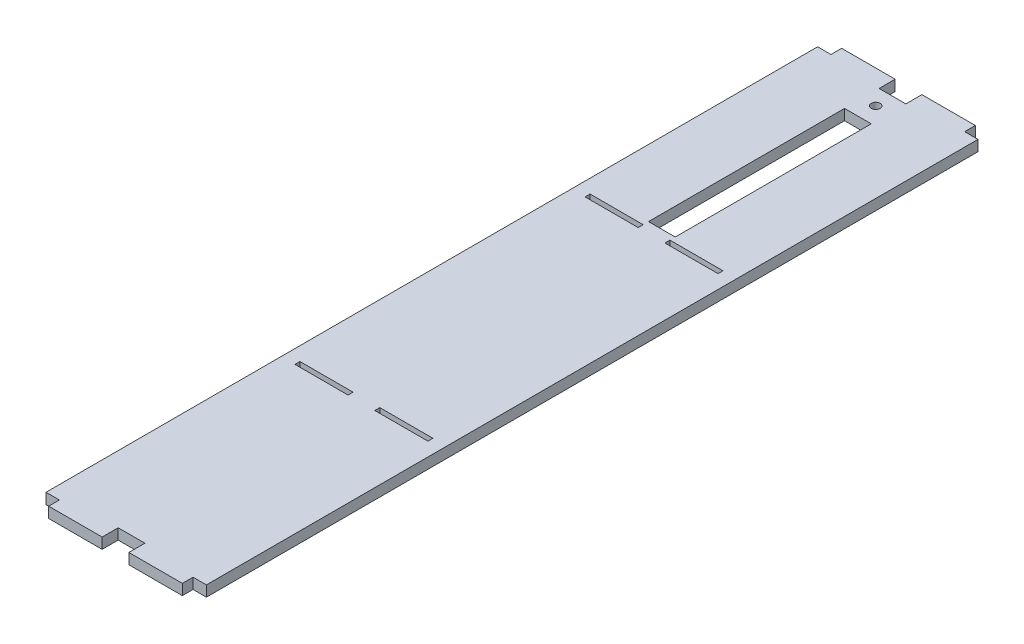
ISO-10303-21;
HEADER;
FILE_DESCRIPTION(('STEP AP214'),'2;1');
FILE_NAME('part.step','',(''),(''),'','','');
FILE_SCHEMA(('AUTOMOTIVE_DESIGN { 1 0 10303 214 1 1 1 1 }'));
ENDSEC;
DATA;
#1=APPLICATION_CONTEXT('core data for automotive mechanical design processes');
#2=APPLICATION_PROTOCOL_DEFINITION('international standard','automotive_design',2000,#1);
#3=PRODUCT_CONTEXT('',#1,'mechanical');
#4=PRODUCT('Part','Part','',(#3));
#5=PRODUCT_RELATED_PRODUCT_CATEGORY('part','',(#4));
#6=PRODUCT_DEFINITION_FORMATION('','',#4);
#7=PRODUCT_DEFINITION_CONTEXT('part definition',#1,'design');
#8=PRODUCT_DEFINITION('design','',#6,#7);
#9=PRODUCT_DEFINITION_SHAPE('','',#8);
#10=(LENGTH_UNIT() NAMED_UNIT(*) SI_UNIT(.MILLI.,.METRE.));
#11=(NAMED_UNIT(*) PLANE_ANGLE_UNIT() SI_UNIT($,.RADIAN.));
#12=(NAMED_UNIT(*) SI_UNIT($,.STERADIAN.) SOLID_ANGLE_UNIT());
#13=UNCERTAINTY_MEASURE_WITH_UNIT(LENGTH_MEASURE(1.E-05),#10,'distance_accuracy_value','');
#14=(GEOMETRIC_REPRESENTATION_CONTEXT(3) GLOBAL_UNCERTAINTY_ASSIGNED_CONTEXT((#13)) GLOBAL_UNIT_ASSIGNED_CONTEXT((#10,
#11,#12)) REPRESENTATION_CONTEXT('',''));
#15=CARTESIAN_POINT('',(0.,0.,0.));
#16=DIRECTION('',(0.,0.,1.));
#17=DIRECTION('',(1.,0.,0.));
#18=AXIS2_PLACEMENT_3D('',#15,#16,#17);
#19=CARTESIAN_POINT('',(0.,6.,0.));
#20=DIRECTION('',(0.,-1.,0.));
#21=DIRECTION('',(0.,0.,-1.));
#22=AXIS2_PLACEMENT_3D('',#19,#20,#21);
#23=PLANE('',#22);
#24=DIRECTION('',(-1.,0.,0.));
#25=VECTOR('',#24,1.);
#26=CARTESIAN_POINT('',(7.69999999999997,6.,-297.6));
#27=LINE('',#26,#25);
#28=CARTESIAN_POINT('',(37.5,6.,-297.6));
#29=VERTEX_POINT('',#28);
#30=CARTESIAN_POINT('',(7.69999999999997,6.,-297.6));
#31=VERTEX_POINT('',#30);
#32=EDGE_CURVE('E329',#29,#31,#27,.T.);
#33=ORIENTED_EDGE('',*,*,#32,.F.);
#34=DIRECTION('',(0.,0.,-1.));
#35=VECTOR('',#34,1.);
#36=CARTESIAN_POINT('',(37.5,6.,-297.6));
#37=LINE('',#36,#35);
#38=CARTESIAN_POINT('',(37.5,6.,-294.8));
#39=VERTEX_POINT('',#38);
#40=EDGE_CURVE('E337',#39,#29,#37,.T.);
#41=ORIENTED_EDGE('',*,*,#40,.F.);
#42=DIRECTION('',(1.,0.,0.));
#43=VECTOR('',#42,1.);
#44=CARTESIAN_POINT('',(7.69999999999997,6.,-294.8));
#45=LINE('',#44,#43);
#46=CARTESIAN_POINT('',(7.69999999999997,6.,-294.8));
#47=VERTEX_POINT('',#46);
#48=EDGE_CURVE('E334',#47,#39,#45,.T.);
#49=ORIENTED_EDGE('',*,*,#48,.F.);
#50=DIRECTION('',(0.,0.,1.));
#51=VECTOR('',#50,1.);
#52=CARTESIAN_POINT('',(7.69999999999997,6.,-297.6));
#53=LINE('',#52,#51);
#54=EDGE_CURVE('E331',#31,#47,#53,.T.);
#55=ORIENTED_EDGE('',*,*,#54,.F.);
#56=EDGE_LOOP('',(#33,#41,#49,#55));
#57=FACE_BOUND('',#56,.T.);
#58=DIRECTION('',(0.,0.,1.));
#59=VECTOR('',#58,1.);
#60=CARTESIAN_POINT('',(52.5,6.,-132.));
#61=LINE('',#60,#59);
#62=CARTESIAN_POINT('',(52.5,6.,-134.8));
#63=VERTEX_POINT('',#62);
#64=CARTESIAN_POINT('',(52.5,6.,-132.));
#65=VERTEX_POINT('',#64);
#66=EDGE_CURVE('E391',#63,#65,#61,.T.);
#67=ORIENTED_EDGE('',*,*,#66,.F.);
#68=DIRECTION('',(-1.,0.,0.));
#69=VECTOR('',#68,1.);
#70=CARTESIAN_POINT('',(82.3,6.,-134.8));
#71=LINE('',#70,#69);
#72=CARTESIAN_POINT('',(82.3,6.,-134.8));
#73=VERTEX_POINT('',#72);
#74=EDGE_CURVE('E399',#73,#63,#71,.T.);
#75=ORIENTED_EDGE('',*,*,#74,.F.);
#76=DIRECTION('',(0.,0.,-1.));
#77=VECTOR('',#76,1.);
#78=CARTESIAN_POINT('',(82.3,6.,-132.));
#79=LINE('',#78,#77);
#80=CARTESIAN_POINT('',(82.3,6.,-132.));
#81=VERTEX_POINT('',#80);
#82=EDGE_CURVE('E396',#81,#73,#79,.T.);
#83=ORIENTED_EDGE('',*,*,#82,.F.);
#84=DIRECTION('',(1.,0.,0.));
#85=VECTOR('',#84,1.);
#86=CARTESIAN_POINT('',(82.3,6.,-132.));
#87=LINE('',#86,#85);
#88=EDGE_CURVE('E393',#65,#81,#87,.T.);
#89=ORIENTED_EDGE('',*,*,#88,.F.);
#90=EDGE_LOOP('',(#67,#75,#83,#89));
#91=FACE_BOUND('',#90,.T.);
#92=DIRECTION('',(0.,0.,1.));
#93=VECTOR('',#92,1.);
#94=CARTESIAN_POINT('',(0.,6.,0.));
#95=LINE('',#94,#93);
#96=CARTESIAN_POINT('',(0.,6.,-433.));
#97=VERTEX_POINT('',#96);
#98=CARTESIAN_POINT('',(0.,6.,0.));
#99=VERTEX_POINT('',#98);
#100=EDGE_CURVE('E453',#97,#99,#95,.T.);
#101=ORIENTED_EDGE('',*,*,#100,.T.);
#102=DIRECTION('',(1.,0.,0.));
#103=VECTOR('',#102,1.);
#104=CARTESIAN_POINT('',(0.,6.,0.));
#105=LINE('',#104,#103);
#106=CARTESIAN_POINT('',(7.5,6.,0.));
#107=VERTEX_POINT('',#106);
#108=EDGE_CURVE('E456',#99,#107,#105,.T.);
#109=ORIENTED_EDGE('',*,*,#108,.T.);
#110=DIRECTION('',(0.,0.,1.));
#111=VECTOR('',#110,1.);
#112=CARTESIAN_POINT('',(7.5,6.,6.));
#113=LINE('',#112,#111);
#114=CARTESIAN_POINT('',(7.5,6.,6.));
#115=VERTEX_POINT('',#114);
#116=EDGE_CURVE('E459',#107,#115,#113,.T.);
#117=ORIENTED_EDGE('',*,*,#116,.T.);
#118=DIRECTION('',(1.,0.,0.));
#119=VECTOR('',#118,1.);
#120=CARTESIAN_POINT('',(7.5,6.,6.));
#121=LINE('',#120,#119);
#122=CARTESIAN_POINT('',(37.5,6.,6.));
#123=VERTEX_POINT('',#122);
#124=EDGE_CURVE('E461',#115,#123,#121,.T.);
#125=ORIENTED_EDGE('',*,*,#124,.T.);
#126=DIRECTION('',(0.,0.,-1.));
#127=VECTOR('',#126,1.);
#128=CARTESIAN_POINT('',(37.5,6.,6.));
#129=LINE('',#128,#127);
#130=CARTESIAN_POINT('',(37.5,6.,-3.));
#131=VERTEX_POINT('',#130);
#132=EDGE_CURVE('E463',#123,#131,#129,.T.);
#133=ORIENTED_EDGE('',*,*,#132,.T.);
#134=DIRECTION('',(1.,0.,0.));
#135=VECTOR('',#134,1.);
#136=CARTESIAN_POINT('',(37.5,6.,-3.));
#137=LINE('',#136,#135);
#138=CARTESIAN_POINT('',(52.5,6.,-3.));
#139=VERTEX_POINT('',#138);
#140=EDGE_CURVE('E465',#131,#139,#137,.T.);
#141=ORIENTED_EDGE('',*,*,#140,.T.);
#142=DIRECTION('',(0.,0.,1.));
#143=VECTOR('',#142,1.);
#144=CARTESIAN_POINT('',(52.5,6.,0.));
#145=LINE('',#144,#143);
#146=CARTESIAN_POINT('',(52.5,6.,6.));
#147=VERTEX_POINT('',#146);
#148=EDGE_CURVE('E467',#139,#147,#145,.T.);
#149=ORIENTED_EDGE('',*,*,#148,.T.);
#150=DIRECTION('',(1.,0.,0.));
#151=VECTOR('',#150,1.);
#152=CARTESIAN_POINT('',(82.5,6.,6.));
#153=LINE('',#152,#151);
#154=CARTESIAN_POINT('',(82.5,6.,6.));
#155=VERTEX_POINT('',#154);
#156=EDGE_CURVE('E469',#147,#155,#153,.T.);
#157=ORIENTED_EDGE('',*,*,#156,.T.);
#158=DIRECTION('',(0.,0.,-1.));
#159=VECTOR('',#158,1.);
#160=CARTESIAN_POINT('',(82.5,6.,6.));
#161=LINE('',#160,#159);
#162=CARTESIAN_POINT('',(82.5,6.,0.));
#163=VERTEX_POINT('',#162);
#164=EDGE_CURVE('E471',#155,#163,#161,.T.);
#165=ORIENTED_EDGE('',*,*,#164,.T.);
#166=DIRECTION('',(1.,0.,0.));
#167=VECTOR('',#166,1.);
#168=CARTESIAN_POINT('',(82.5,6.,0.));
#169=LINE('',#168,#167);
#170=CARTESIAN_POINT('',(90.,6.,0.));
#171=VERTEX_POINT('',#170);
#172=EDGE_CURVE('E473',#163,#171,#169,.T.);
#173=ORIENTED_EDGE('',*,*,#172,.T.);
#174=DIRECTION('',(0.,0.,-1.));
#175=VECTOR('',#174,1.);
#176=CARTESIAN_POINT('',(90.,6.,0.));
#177=LINE('',#176,#175);
#178=CARTESIAN_POINT('',(90.,6.,-433.));
#179=VERTEX_POINT('',#178);
#180=EDGE_CURVE('E475',#171,#179,#177,.T.);
#181=ORIENTED_EDGE('',*,*,#180,.T.);
#182=DIRECTION('',(-1.,0.,0.));
#183=VECTOR('',#182,1.);
#184=CARTESIAN_POINT('',(82.4999999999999,6.,-433.));
#185=LINE('',#184,#183);
#186=CARTESIAN_POINT('',(82.4999999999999,6.,-433.));
#187=VERTEX_POINT('',#186);
#188=EDGE_CURVE('E477',#179,#187,#185,.T.);
#189=ORIENTED_EDGE('',*,*,#188,.T.);
#190=DIRECTION('',(0.,0.,-1.));
#191=VECTOR('',#190,1.);
#192=CARTESIAN_POINT('',(82.5,6.,-439.));
#193=LINE('',#192,#191);
#194=CARTESIAN_POINT('',(82.5,6.,-439.));
#195=VERTEX_POINT('',#194);
#196=EDGE_CURVE('E479',#187,#195,#193,.T.);
#197=ORIENTED_EDGE('',*,*,#196,.T.);
#198=DIRECTION('',(-1.,0.,0.));
#199=VECTOR('',#198,1.);
#200=CARTESIAN_POINT('',(82.5,6.,-439.));
#201=LINE('',#200,#199);
#202=CARTESIAN_POINT('',(52.5,6.,-439.));
#203=VERTEX_POINT('',#202);
#204=EDGE_CURVE('E481',#195,#203,#201,.T.);
#205=ORIENTED_EDGE('',*,*,#204,.T.);
#206=DIRECTION('',(0.,0.,1.));
#207=VECTOR('',#206,1.);
#208=CARTESIAN_POINT('',(52.5,6.,-439.));
#209=LINE('',#208,#207);
#210=CARTESIAN_POINT('',(52.5,6.,-430.));
#211=VERTEX_POINT('',#210);
#212=EDGE_CURVE('E483',#203,#211,#209,.T.);
#213=ORIENTED_EDGE('',*,*,#212,.T.);
#214=DIRECTION('',(-1.,0.,0.));
#215=VECTOR('',#214,1.);
#216=CARTESIAN_POINT('',(37.5,6.,-430.));
#217=LINE('',#216,#215);
#218=CARTESIAN_POINT('',(37.5,6.,-430.));
#219=VERTEX_POINT('',#218);
#220=EDGE_CURVE('E485',#211,#219,#217,.T.);
#221=ORIENTED_EDGE('',*,*,#220,.T.);
#222=DIRECTION('',(0.,0.,-1.));
#223=VECTOR('',#222,1.);
#224=CARTESIAN_POINT('',(37.5,6.,-433.));
#225=LINE('',#224,#223);
#226=CARTESIAN_POINT('',(37.5,6.,-439.));
#227=VERTEX_POINT('',#226);
#228=EDGE_CURVE('E487',#219,#227,#225,.T.);
#229=ORIENTED_EDGE('',*,*,#228,.T.);
#230=DIRECTION('',(-1.,0.,0.));
#231=VECTOR('',#230,1.);
#232=CARTESIAN_POINT('',(7.49999999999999,6.,-439.));
#233=LINE('',#232,#231);
#234=CARTESIAN_POINT('',(7.49999999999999,6.,-439.));
#235=VERTEX_POINT('',#234);
#236=EDGE_CURVE('E489',#227,#235,#233,.T.);
#237=ORIENTED_EDGE('',*,*,#236,.T.);
#238=DIRECTION('',(0.,0.,1.));
#239=VECTOR('',#238,1.);
#240=CARTESIAN_POINT('',(7.49999999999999,6.,-439.));
#241=LINE('',#240,#239);
#242=CARTESIAN_POINT('',(7.5,6.,-433.));
#243=VERTEX_POINT('',#242);
#244=EDGE_CURVE('E491',#235,#243,#241,.T.);
#245=ORIENTED_EDGE('',*,*,#244,.T.);
#246=DIRECTION('',(-1.,0.,0.));
#247=VECTOR('',#246,1.);
#248=CARTESIAN_POINT('',(0.,6.,-433.));
#249=LINE('',#248,#247);
#250=EDGE_CURVE('E493',#243,#97,#249,.T.);
#251=ORIENTED_EDGE('',*,*,#250,.T.);
#252=EDGE_LOOP('',(#101,#109,#117,#125,#133,#141,#149,#157,#165,#173,#181,#189,#197,#205,#213,
#221,#229,#237,#245,#251));
#253=FACE_BOUND('',#252,.T.);
#254=DIRECTION('',(1.,0.,0.));
#255=VECTOR('',#254,1.);
#256=CARTESIAN_POINT('',(7.69999999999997,6.,-132.));
#257=LINE('',#256,#255);
#258=CARTESIAN_POINT('',(7.69999999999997,6.,-132.));
#259=VERTEX_POINT('',#258);
#260=CARTESIAN_POINT('',(37.5,6.,-132.));
#261=VERTEX_POINT('',#260);
#262=EDGE_CURVE('E422',#259,#261,#257,.T.);
#263=ORIENTED_EDGE('',*,*,#262,.F.);
#264=DIRECTION('',(0.,0.,1.));
#265=VECTOR('',#264,1.);
#266=CARTESIAN_POINT('',(7.69999999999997,6.,-132.));
#267=LINE('',#266,#265);
#268=CARTESIAN_POINT('',(7.69999999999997,6.,-134.8));
#269=VERTEX_POINT('',#268);
#270=EDGE_CURVE('E430',#269,#259,#267,.T.);
#271=ORIENTED_EDGE('',*,*,#270,.F.);
#272=DIRECTION('',(-1.,0.,0.));
#273=VECTOR('',#272,1.);
#274=CARTESIAN_POINT('',(7.69999999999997,6.,-134.8));
#275=LINE('',#274,#273);
#276=CARTESIAN_POINT('',(37.5,6.,-134.8));
#277=VERTEX_POINT('',#276);
#278=EDGE_CURVE('E427',#277,#269,#275,.T.);
#279=ORIENTED_EDGE('',*,*,#278,.F.);
#280=DIRECTION('',(0.,0.,-1.));
#281=VECTOR('',#280,1.);
#282=CARTESIAN_POINT('',(37.5,6.,-132.));
#283=LINE('',#282,#281);
#284=EDGE_CURVE('E424',#261,#277,#283,.T.);
#285=ORIENTED_EDGE('',*,*,#284,.F.);
#286=EDGE_LOOP('',(#263,#271,#279,#285));
#287=FACE_BOUND('',#286,.T.);
#288=DIRECTION('',(1.,0.,0.));
#289=VECTOR('',#288,1.);
#290=CARTESIAN_POINT('',(82.3,6.,-294.8));
#291=LINE('',#290,#289);
#292=CARTESIAN_POINT('',(52.5,6.,-294.8));
#293=VERTEX_POINT('',#292);
#294=CARTESIAN_POINT('',(82.3,6.,-294.8));
#295=VERTEX_POINT('',#294);
#296=EDGE_CURVE('E360',#293,#295,#291,.T.);
#297=ORIENTED_EDGE('',*,*,#296,.F.);
#298=DIRECTION('',(0.,0.,1.));
#299=VECTOR('',#298,1.);
#300=CARTESIAN_POINT('',(52.5,6.,-297.6));
#301=LINE('',#300,#299);
#302=CARTESIAN_POINT('',(52.5,6.,-297.6));
#303=VERTEX_POINT('',#302);
#304=EDGE_CURVE('E368',#303,#293,#301,.T.);
#305=ORIENTED_EDGE('',*,*,#304,.F.);
#306=DIRECTION('',(-1.,0.,0.));
#307=VECTOR('',#306,1.);
#308=CARTESIAN_POINT('',(82.3,6.,-297.6));
#309=LINE('',#308,#307);
#310=CARTESIAN_POINT('',(82.3,6.,-297.6));
#311=VERTEX_POINT('',#310);
#312=EDGE_CURVE('E365',#311,#303,#309,.T.);
#313=ORIENTED_EDGE('',*,*,#312,.F.);
#314=DIRECTION('',(0.,0.,-1.));
#315=VECTOR('',#314,1.);
#316=CARTESIAN_POINT('',(82.3,6.,-297.6));
#317=LINE('',#316,#315);
#318=EDGE_CURVE('E362',#295,#311,#317,.T.);
#319=ORIENTED_EDGE('',*,*,#318,.F.);
#320=EDGE_LOOP('',(#297,#305,#313,#319));
#321=FACE_BOUND('',#320,.T.);
#322=DIRECTION('',(0.,0.,1.));
#323=VECTOR('',#322,1.);
#324=CARTESIAN_POINT('',(37.5,6.,-410.6));
#325=LINE('',#324,#323);
#326=CARTESIAN_POINT('',(37.5,6.,-410.6));
#327=VERTEX_POINT('',#326);
#328=CARTESIAN_POINT('',(37.5,6.,-300.6));
#329=VERTEX_POINT('',#328);
#330=EDGE_CURVE('E290',#327,#329,#325,.T.);
#331=ORIENTED_EDGE('',*,*,#330,.F.);
#332=DIRECTION('',(-1.,0.,0.));
#333=VECTOR('',#332,1.);
#334=CARTESIAN_POINT('',(37.5,6.,-410.6));
#335=LINE('',#334,#333);
#336=CARTESIAN_POINT('',(52.5,6.,-410.6));
#337=VERTEX_POINT('',#336);
#338=EDGE_CURVE('E313',#337,#327,#335,.T.);
#339=ORIENTED_EDGE('',*,*,#338,.F.);
#340=DIRECTION('',(0.,0.,-1.));
#341=VECTOR('',#340,1.);
#342=CARTESIAN_POINT('',(52.5,6.,-410.6));
#343=LINE('',#342,#341);
#344=CARTESIAN_POINT('',(52.5,6.,-300.6));
#345=VERTEX_POINT('',#344);
#346=EDGE_CURVE('E311',#345,#337,#343,.T.);
#347=ORIENTED_EDGE('',*,*,#346,.F.);
#348=DIRECTION('',(1.,0.,0.));
#349=VECTOR('',#348,1.);
#350=CARTESIAN_POINT('',(37.5,6.,-300.6));
#351=LINE('',#350,#349);
#352=EDGE_CURVE('E298',#329,#345,#351,.T.);
#353=ORIENTED_EDGE('',*,*,#352,.F.);
#354=EDGE_LOOP('',(#331,#339,#347,#353));
#355=FACE_BOUND('',#354,.T.);
#356=CARTESIAN_POINT('',(45.,6.,-420.6));
#357=DIRECTION('',(0.,1.,0.));
#358=DIRECTION('',(0.,0.,1.));
#359=AXIS2_PLACEMENT_3D('',#356,#357,#358);
#360=CIRCLE('',#359,2.5);
#361=CARTESIAN_POINT('',(45.,6.,-418.1));
#362=VERTEX_POINT('',#361);
#363=EDGE_CURVE('E319',#362,#362,#360,.T.);
#364=ORIENTED_EDGE('',*,*,#363,.F.);
#365=EDGE_LOOP('',(#364));
#366=FACE_BOUND('',#365,.T.);
#367=ADVANCED_FACE('F33',(#57,#91,#253,#287,#321,#355,#366),#23,.F.);
#368=CARTESIAN_POINT('',(0.,0.,0.));
#369=DIRECTION('',(0.,-1.,0.));
#370=DIRECTION('',(0.,0.,-1.));
#371=AXIS2_PLACEMENT_3D('',#368,#369,#370);
#372=PLANE('',#371);
#373=DIRECTION('',(-1.,0.,0.));
#374=VECTOR('',#373,1.);
#375=CARTESIAN_POINT('',(37.5,0.,-410.6));
#376=LINE('',#375,#374);
#377=CARTESIAN_POINT('',(52.5,0.,-410.6));
#378=VERTEX_POINT('',#377);
#379=CARTESIAN_POINT('',(37.5,0.,-410.6));
#380=VERTEX_POINT('',#379);
#381=EDGE_CURVE('E299',#378,#380,#376,.T.);
#382=ORIENTED_EDGE('',*,*,#381,.T.);
#383=DIRECTION('',(0.,0.,1.));
#384=VECTOR('',#383,1.);
#385=CARTESIAN_POINT('',(37.5,0.,-410.6));
#386=LINE('',#385,#384);
#387=CARTESIAN_POINT('',(37.5,0.,-300.6));
#388=VERTEX_POINT('',#387);
#389=EDGE_CURVE('E56',#380,#388,#386,.T.);
#390=ORIENTED_EDGE('',*,*,#389,.T.);
#391=DIRECTION('',(1.,0.,0.));
#392=VECTOR('',#391,1.);
#393=CARTESIAN_POINT('',(37.5,0.,-300.6));
#394=LINE('',#393,#392);
#395=CARTESIAN_POINT('',(52.5,0.,-300.6));
#396=VERTEX_POINT('',#395);
#397=EDGE_CURVE('E305',#388,#396,#394,.T.);
#398=ORIENTED_EDGE('',*,*,#397,.T.);
#399=DIRECTION('',(0.,0.,-1.));
#400=VECTOR('',#399,1.);
#401=CARTESIAN_POINT('',(52.5,0.,-410.6));
#402=LINE('',#401,#400);
#403=EDGE_CURVE('E321',#396,#378,#402,.T.);
#404=ORIENTED_EDGE('',*,*,#403,.T.);
#405=EDGE_LOOP('',(#382,#390,#398,#404));
#406=FACE_BOUND('',#405,.T.);
#407=DIRECTION('',(0.,0.,-1.));
#408=VECTOR('',#407,1.);
#409=CARTESIAN_POINT('',(37.5,0.,-297.6));
#410=LINE('',#409,#408);
#411=CARTESIAN_POINT('',(37.5,0.,-294.8));
#412=VERTEX_POINT('',#411);
#413=CARTESIAN_POINT('',(37.5,0.,-297.6));
#414=VERTEX_POINT('',#413);
#415=EDGE_CURVE('E332',#412,#414,#410,.T.);
#416=ORIENTED_EDGE('',*,*,#415,.T.);
#417=DIRECTION('',(-1.,0.,0.));
#418=VECTOR('',#417,1.);
#419=CARTESIAN_POINT('',(7.69999999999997,0.,-297.6));
#420=LINE('',#419,#418);
#421=CARTESIAN_POINT('',(7.69999999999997,0.,-297.6));
#422=VERTEX_POINT('',#421);
#423=EDGE_CURVE('E306',#414,#422,#420,.T.);
#424=ORIENTED_EDGE('',*,*,#423,.T.);
#425=DIRECTION('',(0.,0.,1.));
#426=VECTOR('',#425,1.);
#427=CARTESIAN_POINT('',(7.69999999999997,0.,-297.6));
#428=LINE('',#427,#426);
#429=CARTESIAN_POINT('',(7.69999999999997,0.,-294.8));
#430=VERTEX_POINT('',#429);
#431=EDGE_CURVE('E342',#422,#430,#428,.T.);
#432=ORIENTED_EDGE('',*,*,#431,.T.);
#433=DIRECTION('',(1.,0.,0.));
#434=VECTOR('',#433,1.);
#435=CARTESIAN_POINT('',(7.69999999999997,0.,-294.8));
#436=LINE('',#435,#434);
#437=EDGE_CURVE('E345',#430,#412,#436,.T.);
#438=ORIENTED_EDGE('',*,*,#437,.T.);
#439=EDGE_LOOP('',(#416,#424,#432,#438));
#440=FACE_BOUND('',#439,.T.);
#441=DIRECTION('',(0.,0.,1.));
#442=VECTOR('',#441,1.);
#443=CARTESIAN_POINT('',(52.5,0.,-297.6));
#444=LINE('',#443,#442);
#445=CARTESIAN_POINT('',(52.5,0.,-297.6));
#446=VERTEX_POINT('',#445);
#447=CARTESIAN_POINT('',(52.5,0.,-294.8));
#448=VERTEX_POINT('',#447);
#449=EDGE_CURVE('E363',#446,#448,#444,.T.);
#450=ORIENTED_EDGE('',*,*,#449,.T.);
#451=DIRECTION('',(1.,0.,0.));
#452=VECTOR('',#451,1.);
#453=CARTESIAN_POINT('',(82.3,0.,-294.8));
#454=LINE('',#453,#452);
#455=CARTESIAN_POINT('',(82.3,0.,-294.8));
#456=VERTEX_POINT('',#455);
#457=EDGE_CURVE('E359',#448,#456,#454,.T.);
#458=ORIENTED_EDGE('',*,*,#457,.T.);
#459=DIRECTION('',(0.,0.,-1.));
#460=VECTOR('',#459,1.);
#461=CARTESIAN_POINT('',(82.3,0.,-297.6));
#462=LINE('',#461,#460);
#463=CARTESIAN_POINT('',(82.3,0.,-297.6));
#464=VERTEX_POINT('',#463);
#465=EDGE_CURVE('E373',#456,#464,#462,.T.);
#466=ORIENTED_EDGE('',*,*,#465,.T.);
#467=DIRECTION('',(-1.,0.,0.));
#468=VECTOR('',#467,1.);
#469=CARTESIAN_POINT('',(82.3,0.,-297.6));
#470=LINE('',#469,#468);
#471=EDGE_CURVE('E376',#464,#446,#470,.T.);
#472=ORIENTED_EDGE('',*,*,#471,.T.);
#473=EDGE_LOOP('',(#450,#458,#466,#472));
#474=FACE_BOUND('',#473,.T.);
#475=DIRECTION('',(-1.,0.,0.));
#476=VECTOR('',#475,1.);
#477=CARTESIAN_POINT('',(82.3,0.,-134.8));
#478=LINE('',#477,#476);
#479=CARTESIAN_POINT('',(82.3,0.,-134.8));
#480=VERTEX_POINT('',#479);
#481=CARTESIAN_POINT('',(52.5,0.,-134.8));
#482=VERTEX_POINT('',#481);
#483=EDGE_CURVE('E394',#480,#482,#478,.T.);
#484=ORIENTED_EDGE('',*,*,#483,.T.);
#485=DIRECTION('',(0.,0.,1.));
#486=VECTOR('',#485,1.);
#487=CARTESIAN_POINT('',(52.5,0.,-132.));
#488=LINE('',#487,#486);
#489=CARTESIAN_POINT('',(52.5,0.,-132.));
#490=VERTEX_POINT('',#489);
#491=EDGE_CURVE('E390',#482,#490,#488,.T.);
#492=ORIENTED_EDGE('',*,*,#491,.T.);
#493=DIRECTION('',(1.,0.,0.));
#494=VECTOR('',#493,1.);
#495=CARTESIAN_POINT('',(82.3,0.,-132.));
#496=LINE('',#495,#494);
#497=CARTESIAN_POINT('',(82.3,0.,-132.));
#498=VERTEX_POINT('',#497);
#499=EDGE_CURVE('E404',#490,#498,#496,.T.);
#500=ORIENTED_EDGE('',*,*,#499,.T.);
#501=DIRECTION('',(0.,0.,-1.));
#502=VECTOR('',#501,1.);
#503=CARTESIAN_POINT('',(82.3,0.,-132.));
#504=LINE('',#503,#502);
#505=EDGE_CURVE('E407',#498,#480,#504,.T.);
#506=ORIENTED_EDGE('',*,*,#505,.T.);
#507=EDGE_LOOP('',(#484,#492,#500,#506));
#508=FACE_BOUND('',#507,.T.);
#509=DIRECTION('',(0.,0.,1.));
#510=VECTOR('',#509,1.);
#511=CARTESIAN_POINT('',(7.69999999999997,0.,-132.));
#512=LINE('',#511,#510);
#513=CARTESIAN_POINT('',(7.69999999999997,0.,-134.8));
#514=VERTEX_POINT('',#513);
#515=CARTESIAN_POINT('',(7.69999999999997,0.,-132.));
#516=VERTEX_POINT('',#515);
#517=EDGE_CURVE('E425',#514,#516,#512,.T.);
#518=ORIENTED_EDGE('',*,*,#517,.T.);
#519=DIRECTION('',(1.,0.,0.));
#520=VECTOR('',#519,1.);
#521=CARTESIAN_POINT('',(7.69999999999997,0.,-132.));
#522=LINE('',#521,#520);
#523=CARTESIAN_POINT('',(37.5,0.,-132.));
#524=VERTEX_POINT('',#523);
#525=EDGE_CURVE('E421',#516,#524,#522,.T.);
#526=ORIENTED_EDGE('',*,*,#525,.T.);
#527=DIRECTION('',(0.,0.,-1.));
#528=VECTOR('',#527,1.);
#529=CARTESIAN_POINT('',(37.5,0.,-132.));
#530=LINE('',#529,#528);
#531=CARTESIAN_POINT('',(37.5,0.,-134.8));
#532=VERTEX_POINT('',#531);
#533=EDGE_CURVE('E435',#524,#532,#530,.T.);
#534=ORIENTED_EDGE('',*,*,#533,.T.);
#535=DIRECTION('',(-1.,0.,0.));
#536=VECTOR('',#535,1.);
#537=CARTESIAN_POINT('',(7.69999999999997,0.,-134.8));
#538=LINE('',#537,#536);
#539=EDGE_CURVE('E438',#532,#514,#538,.T.);
#540=ORIENTED_EDGE('',*,*,#539,.T.);
#541=EDGE_LOOP('',(#518,#526,#534,#540));
#542=FACE_BOUND('',#541,.T.);
#543=DIRECTION('',(0.,0.,1.));
#544=VECTOR('',#543,1.);
#545=CARTESIAN_POINT('',(0.,0.,0.));
#546=LINE('',#545,#544);
#547=CARTESIAN_POINT('',(0.,0.,-433.));
#548=VERTEX_POINT('',#547);
#549=CARTESIAN_POINT('',(0.,0.,0.));
#550=VERTEX_POINT('',#549);
#551=EDGE_CURVE('E452',#548,#550,#546,.T.);
#552=ORIENTED_EDGE('',*,*,#551,.F.);
#553=DIRECTION('',(-1.,0.,0.));
#554=VECTOR('',#553,1.);
#555=CARTESIAN_POINT('',(0.,0.,-433.));
#556=LINE('',#555,#554);
#557=CARTESIAN_POINT('',(7.5,0.,-433.));
#558=VERTEX_POINT('',#557);
#559=EDGE_CURVE('E457',#558,#548,#556,.T.);
#560=ORIENTED_EDGE('',*,*,#559,.F.);
#561=DIRECTION('',(0.,0.,1.));
#562=VECTOR('',#561,1.);
#563=CARTESIAN_POINT('',(7.49999999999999,0.,-439.));
#564=LINE('',#563,#562);
#565=CARTESIAN_POINT('',(7.49999999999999,0.,-439.));
#566=VERTEX_POINT('',#565);
#567=EDGE_CURVE('E536',#566,#558,#564,.T.);
#568=ORIENTED_EDGE('',*,*,#567,.F.);
#569=DIRECTION('',(-1.,0.,0.));
#570=VECTOR('',#569,1.);
#571=CARTESIAN_POINT('',(7.49999999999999,0.,-439.));
#572=LINE('',#571,#570);
#573=CARTESIAN_POINT('',(37.5,0.,-439.));
#574=VERTEX_POINT('',#573);
#575=EDGE_CURVE('E534',#574,#566,#572,.T.);
#576=ORIENTED_EDGE('',*,*,#575,.F.);
#577=DIRECTION('',(0.,0.,-1.));
#578=VECTOR('',#577,1.);
#579=CARTESIAN_POINT('',(37.5,0.,-439.));
#580=LINE('',#579,#578);
#581=CARTESIAN_POINT('',(37.5,0.,-430.));
#582=VERTEX_POINT('',#581);
#583=EDGE_CURVE('E532',#582,#574,#580,.T.);
#584=ORIENTED_EDGE('',*,*,#583,.F.);
#585=DIRECTION('',(-1.,0.,0.));
#586=VECTOR('',#585,1.);
#587=CARTESIAN_POINT('',(37.5,0.,-430.));
#588=LINE('',#587,#586);
#589=CARTESIAN_POINT('',(52.5,0.,-430.));
#590=VERTEX_POINT('',#589);
#591=EDGE_CURVE('E529',#590,#582,#588,.T.);
#592=ORIENTED_EDGE('',*,*,#591,.F.);
#593=DIRECTION('',(0.,0.,1.));
#594=VECTOR('',#593,1.);
#595=CARTESIAN_POINT('',(52.5,0.,-433.));
#596=LINE('',#595,#594);
#597=CARTESIAN_POINT('',(52.5,0.,-439.));
#598=VERTEX_POINT('',#597);
#599=EDGE_CURVE('E527',#598,#590,#596,.T.);
#600=ORIENTED_EDGE('',*,*,#599,.F.);
#601=DIRECTION('',(-1.,0.,0.));
#602=VECTOR('',#601,1.);
#603=CARTESIAN_POINT('',(82.5,0.,-439.));
#604=LINE('',#603,#602);
#605=CARTESIAN_POINT('',(82.5,0.,-439.));
#606=VERTEX_POINT('',#605);
#607=EDGE_CURVE('E524',#606,#598,#604,.T.);
#608=ORIENTED_EDGE('',*,*,#607,.F.);
#609=DIRECTION('',(0.,0.,-1.));
#610=VECTOR('',#609,1.);
#611=CARTESIAN_POINT('',(82.5,0.,-439.));
#612=LINE('',#611,#610);
#613=CARTESIAN_POINT('',(82.4999999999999,0.,-433.));
#614=VERTEX_POINT('',#613);
#615=EDGE_CURVE('E522',#614,#606,#612,.T.);
#616=ORIENTED_EDGE('',*,*,#615,.F.);
#617=DIRECTION('',(-1.,0.,0.));
#618=VECTOR('',#617,1.);
#619=CARTESIAN_POINT('',(82.4999999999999,0.,-433.));
#620=LINE('',#619,#618);
#621=CARTESIAN_POINT('',(90.,0.,-433.));
#622=VERTEX_POINT('',#621);
#623=EDGE_CURVE('E520',#622,#614,#620,.T.);
#624=ORIENTED_EDGE('',*,*,#623,.F.);
#625=DIRECTION('',(0.,0.,-1.));
#626=VECTOR('',#625,1.);
#627=CARTESIAN_POINT('',(90.,0.,0.));
#628=LINE('',#627,#626);
#629=CARTESIAN_POINT('',(90.,0.,0.));
#630=VERTEX_POINT('',#629);
#631=EDGE_CURVE('E518',#630,#622,#628,.T.);
#632=ORIENTED_EDGE('',*,*,#631,.F.);
#633=DIRECTION('',(1.,0.,0.));
#634=VECTOR('',#633,1.);
#635=CARTESIAN_POINT('',(82.5,0.,0.));
#636=LINE('',#635,#634);
#637=CARTESIAN_POINT('',(82.5,0.,0.));
#638=VERTEX_POINT('',#637);
#639=EDGE_CURVE('E516',#638,#630,#636,.T.);
#640=ORIENTED_EDGE('',*,*,#639,.F.);
#641=DIRECTION('',(0.,0.,-1.));
#642=VECTOR('',#641,1.);
#643=CARTESIAN_POINT('',(82.5,0.,6.));
#644=LINE('',#643,#642);
#645=CARTESIAN_POINT('',(82.5,0.,6.));
#646=VERTEX_POINT('',#645);
#647=EDGE_CURVE('E514',#646,#638,#644,.T.);
#648=ORIENTED_EDGE('',*,*,#647,.F.);
#649=DIRECTION('',(1.,0.,0.));
#650=VECTOR('',#649,1.);
#651=CARTESIAN_POINT('',(82.5,0.,6.));
#652=LINE('',#651,#650);
#653=CARTESIAN_POINT('',(52.5,0.,6.));
#654=VERTEX_POINT('',#653);
#655=EDGE_CURVE('E512',#654,#646,#652,.T.);
#656=ORIENTED_EDGE('',*,*,#655,.F.);
#657=DIRECTION('',(0.,0.,1.));
#658=VECTOR('',#657,1.);
#659=CARTESIAN_POINT('',(52.5,0.,6.));
#660=LINE('',#659,#658);
#661=CARTESIAN_POINT('',(52.5,0.,-3.));
#662=VERTEX_POINT('',#661);
#663=EDGE_CURVE('E510',#662,#654,#660,.T.);
#664=ORIENTED_EDGE('',*,*,#663,.F.);
#665=DIRECTION('',(1.,0.,0.));
#666=VECTOR('',#665,1.);
#667=CARTESIAN_POINT('',(37.5,0.,-3.));
#668=LINE('',#667,#666);
#669=CARTESIAN_POINT('',(37.5,0.,-3.));
#670=VERTEX_POINT('',#669);
#671=EDGE_CURVE('E507',#670,#662,#668,.T.);
#672=ORIENTED_EDGE('',*,*,#671,.F.);
#673=DIRECTION('',(0.,0.,-1.));
#674=VECTOR('',#673,1.);
#675=CARTESIAN_POINT('',(37.5,0.,0.));
#676=LINE('',#675,#674);
#677=CARTESIAN_POINT('',(37.5,0.,6.));
#678=VERTEX_POINT('',#677);
#679=EDGE_CURVE('E505',#678,#670,#676,.T.);
#680=ORIENTED_EDGE('',*,*,#679,.F.);
#681=DIRECTION('',(1.,0.,0.));
#682=VECTOR('',#681,1.);
#683=CARTESIAN_POINT('',(7.5,0.,6.));
#684=LINE('',#683,#682);
#685=CARTESIAN_POINT('',(7.5,0.,6.));
#686=VERTEX_POINT('',#685);
#687=EDGE_CURVE('E502',#686,#678,#684,.T.);
#688=ORIENTED_EDGE('',*,*,#687,.F.);
#689=DIRECTION('',(0.,0.,1.));
#690=VECTOR('',#689,1.);
#691=CARTESIAN_POINT('',(7.5,0.,6.));
#692=LINE('',#691,#690);
#693=CARTESIAN_POINT('',(7.5,0.,0.));
#694=VERTEX_POINT('',#693);
#695=EDGE_CURVE('E500',#694,#686,#692,.T.);
#696=ORIENTED_EDGE('',*,*,#695,.F.);
#697=DIRECTION('',(1.,0.,0.));
#698=VECTOR('',#697,1.);
#699=CARTESIAN_POINT('',(0.,0.,0.));
#700=LINE('',#699,#698);
#701=EDGE_CURVE('E498',#550,#694,#700,.T.);
#702=ORIENTED_EDGE('',*,*,#701,.F.);
#703=EDGE_LOOP('',(#552,#560,#568,#576,#584,#592,#600,#608,#616,#624,#632,#640,#648,#656,#664,
#672,#680,#688,#696,#702));
#704=FACE_BOUND('',#703,.T.);
#705=CARTESIAN_POINT('',(45.,0.,-420.6));
#706=DIRECTION('',(0.,1.,0.));
#707=DIRECTION('',(0.,0.,1.));
#708=AXIS2_PLACEMENT_3D('',#705,#706,#707);
#709=CIRCLE('',#708,2.5);
#710=CARTESIAN_POINT('',(45.,0.,-418.1));
#711=VERTEX_POINT('',#710);
#712=EDGE_CURVE('E1090',#711,#711,#709,.T.);
#713=ORIENTED_EDGE('',*,*,#712,.T.);
#714=EDGE_LOOP('',(#713));
#715=FACE_BOUND('',#714,.T.);
#716=ADVANCED_FACE('F602',(#406,#440,#474,#508,#542,#704,#715),#372,.T.);
#717=CARTESIAN_POINT('',(0.,6.,0.));
#718=DIRECTION('',(1.,0.,0.));
#719=DIRECTION('',(0.,0.,-1.));
#720=AXIS2_PLACEMENT_3D('',#717,#718,#719);
#721=PLANE('',#720);
#722=ORIENTED_EDGE('',*,*,#551,.T.);
#723=DIRECTION('',(0.,-1.,0.));
#724=VECTOR('',#723,1.);
#725=CARTESIAN_POINT('',(0.,6.,0.));
#726=LINE('',#725,#724);
#727=EDGE_CURVE('E11',#99,#550,#726,.T.);
#728=ORIENTED_EDGE('',*,*,#727,.F.);
#729=ORIENTED_EDGE('',*,*,#100,.F.);
#730=DIRECTION('',(0.,-1.,0.));
#731=VECTOR('',#730,1.);
#732=CARTESIAN_POINT('',(0.,6.,-433.));
#733=LINE('',#732,#731);
#734=EDGE_CURVE('E495',#97,#548,#733,.T.);
#735=ORIENTED_EDGE('',*,*,#734,.T.);
#736=EDGE_LOOP('',(#722,#728,#729,#735));
#737=FACE_BOUND('',#736,.T.);
#738=ADVANCED_FACE('F35',(#737),#721,.F.);
#739=CARTESIAN_POINT('',(0.,6.,0.));
#740=DIRECTION('',(0.,0.,-1.));
#741=DIRECTION('',(-1.,0.,0.));
#742=AXIS2_PLACEMENT_3D('',#739,#740,#741);
#743=PLANE('',#742);
#744=ORIENTED_EDGE('',*,*,#701,.T.);
#745=DIRECTION('',(0.,-1.,0.));
#746=VECTOR('',#745,1.);
#747=CARTESIAN_POINT('',(7.5,6.,0.));
#748=LINE('',#747,#746);
#749=EDGE_CURVE('E41',#107,#694,#748,.T.);
#750=ORIENTED_EDGE('',*,*,#749,.F.);
#751=ORIENTED_EDGE('',*,*,#108,.F.);
#752=ORIENTED_EDGE('',*,*,#727,.T.);
#753=EDGE_LOOP('',(#744,#750,#751,#752));
#754=FACE_BOUND('',#753,.T.);
#755=ADVANCED_FACE('F619',(#754),#743,.F.);
#756=CARTESIAN_POINT('',(7.5,6.,6.));
#757=DIRECTION('',(1.,0.,0.));
#758=DIRECTION('',(0.,0.,-1.));
#759=AXIS2_PLACEMENT_3D('',#756,#757,#758);
#760=PLANE('',#759);
#761=ORIENTED_EDGE('',*,*,#695,.T.);
#762=DIRECTION('',(0.,-1.,0.));
#763=VECTOR('',#762,1.);
#764=CARTESIAN_POINT('',(7.5,6.,6.));
#765=LINE('',#764,#763);
#766=EDGE_CURVE('E589',#115,#686,#765,.T.);
#767=ORIENTED_EDGE('',*,*,#766,.F.);
#768=ORIENTED_EDGE('',*,*,#116,.F.);
#769=ORIENTED_EDGE('',*,*,#749,.T.);
#770=EDGE_LOOP('',(#761,#767,#768,#769));
#771=FACE_BOUND('',#770,.T.);
#772=ADVANCED_FACE('F596',(#771),#760,.F.);
#773=CARTESIAN_POINT('',(7.5,6.,6.));
#774=DIRECTION('',(0.,0.,-1.));
#775=DIRECTION('',(-1.,0.,0.));
#776=AXIS2_PLACEMENT_3D('',#773,#774,#775);
#777=PLANE('',#776);
#778=ORIENTED_EDGE('',*,*,#687,.T.);
#779=DIRECTION('',(0.,-1.,0.));
#780=VECTOR('',#779,1.);
#781=CARTESIAN_POINT('',(37.5,6.,6.));
#782=LINE('',#781,#780);
#783=EDGE_CURVE('E586',#123,#678,#782,.T.);
#784=ORIENTED_EDGE('',*,*,#783,.F.);
#785=ORIENTED_EDGE('',*,*,#124,.F.);
#786=ORIENTED_EDGE('',*,*,#766,.T.);
#787=EDGE_LOOP('',(#778,#784,#785,#786));
#788=FACE_BOUND('',#787,.T.);
#789=ADVANCED_FACE('F607',(#788),#777,.F.);
#790=CARTESIAN_POINT('',(37.5,6.,0.));
#791=DIRECTION('',(-1.,0.,0.));
#792=DIRECTION('',(0.,0.,1.));
#793=AXIS2_PLACEMENT_3D('',#790,#791,#792);
#794=PLANE('',#793);
#795=ORIENTED_EDGE('',*,*,#679,.T.);
#796=DIRECTION('',(0.,-1.,0.));
#797=VECTOR('',#796,1.);
#798=CARTESIAN_POINT('',(37.5,6.,-3.));
#799=LINE('',#798,#797);
#800=EDGE_CURVE('E583',#131,#670,#799,.T.);
#801=ORIENTED_EDGE('',*,*,#800,.F.);
#802=ORIENTED_EDGE('',*,*,#132,.F.);
#803=ORIENTED_EDGE('',*,*,#783,.T.);
#804=EDGE_LOOP('',(#795,#801,#802,#803));
#805=FACE_BOUND('',#804,.T.);
#806=ADVANCED_FACE('F611',(#805),#794,.F.);
#807=CARTESIAN_POINT('',(37.5,6.,-3.));
#808=DIRECTION('',(0.,0.,-1.));
#809=DIRECTION('',(-1.,0.,0.));
#810=AXIS2_PLACEMENT_3D('',#807,#808,#809);
#811=PLANE('',#810);
#812=ORIENTED_EDGE('',*,*,#671,.T.);
#813=DIRECTION('',(0.,-1.,0.));
#814=VECTOR('',#813,1.);
#815=CARTESIAN_POINT('',(52.5,6.,-3.));
#816=LINE('',#815,#814);
#817=EDGE_CURVE('E580',#139,#662,#816,.T.);
#818=ORIENTED_EDGE('',*,*,#817,.F.);
#819=ORIENTED_EDGE('',*,*,#140,.F.);
#820=ORIENTED_EDGE('',*,*,#800,.T.);
#821=EDGE_LOOP('',(#812,#818,#819,#820));
#822=FACE_BOUND('',#821,.T.);
#823=ADVANCED_FACE('F689',(#822),#811,.F.);
#824=CARTESIAN_POINT('',(52.5,6.,6.));
#825=DIRECTION('',(1.,0.,0.));
#826=DIRECTION('',(0.,0.,-1.));
#827=AXIS2_PLACEMENT_3D('',#824,#825,#826);
#828=PLANE('',#827);
#829=ORIENTED_EDGE('',*,*,#663,.T.);
#830=DIRECTION('',(0.,-1.,0.));
#831=VECTOR('',#830,1.);
#832=CARTESIAN_POINT('',(52.5,6.,6.));
#833=LINE('',#832,#831);
#834=EDGE_CURVE('E577',#147,#654,#833,.T.);
#835=ORIENTED_EDGE('',*,*,#834,.F.);
#836=ORIENTED_EDGE('',*,*,#148,.F.);
#837=ORIENTED_EDGE('',*,*,#817,.T.);
#838=EDGE_LOOP('',(#829,#835,#836,#837));
#839=FACE_BOUND('',#838,.T.);
#840=ADVANCED_FACE('F687',(#839),#828,.F.);
#841=CARTESIAN_POINT('',(82.5,6.,6.));
#842=DIRECTION('',(0.,0.,-1.));
#843=DIRECTION('',(-1.,0.,0.));
#844=AXIS2_PLACEMENT_3D('',#841,#842,#843);
#845=PLANE('',#844);
#846=ORIENTED_EDGE('',*,*,#655,.T.);
#847=DIRECTION('',(0.,-1.,0.));
#848=VECTOR('',#847,1.);
#849=CARTESIAN_POINT('',(82.5,6.,6.));
#850=LINE('',#849,#848);
#851=EDGE_CURVE('E574',#155,#646,#850,.T.);
#852=ORIENTED_EDGE('',*,*,#851,.F.);
#853=ORIENTED_EDGE('',*,*,#156,.F.);
#854=ORIENTED_EDGE('',*,*,#834,.T.);
#855=EDGE_LOOP('',(#846,#852,#853,#854));
#856=FACE_BOUND('',#855,.T.);
#857=ADVANCED_FACE('F683',(#856),#845,.F.);
#858=CARTESIAN_POINT('',(82.5,6.,6.));
#859=DIRECTION('',(-1.,0.,0.));
#860=DIRECTION('',(0.,0.,1.));
#861=AXIS2_PLACEMENT_3D('',#858,#859,#860);
#862=PLANE('',#861);
#863=ORIENTED_EDGE('',*,*,#647,.T.);
#864=DIRECTION('',(0.,-1.,0.));
#865=VECTOR('',#864,1.);
#866=CARTESIAN_POINT('',(82.5,6.,0.));
#867=LINE('',#866,#865);
#868=EDGE_CURVE('E571',#163,#638,#867,.T.);
#869=ORIENTED_EDGE('',*,*,#868,.F.);
#870=ORIENTED_EDGE('',*,*,#164,.F.);
#871=ORIENTED_EDGE('',*,*,#851,.T.);
#872=EDGE_LOOP('',(#863,#869,#870,#871));
#873=FACE_BOUND('',#872,.T.);
#874=ADVANCED_FACE('F678',(#873),#862,.F.);
#875=CARTESIAN_POINT('',(82.5,6.,0.));
#876=DIRECTION('',(0.,0.,-1.));
#877=DIRECTION('',(-1.,0.,0.));
#878=AXIS2_PLACEMENT_3D('',#875,#876,#877);
#879=PLANE('',#878);
#880=ORIENTED_EDGE('',*,*,#639,.T.);
#881=DIRECTION('',(0.,-1.,0.));
#882=VECTOR('',#881,1.);
#883=CARTESIAN_POINT('',(90.,6.,0.));
#884=LINE('',#883,#882);
#885=EDGE_CURVE('E568',#171,#630,#884,.T.);
#886=ORIENTED_EDGE('',*,*,#885,.F.);
#887=ORIENTED_EDGE('',*,*,#172,.F.);
#888=ORIENTED_EDGE('',*,*,#868,.T.);
#889=EDGE_LOOP('',(#880,#886,#887,#888));
#890=FACE_BOUND('',#889,.T.);
#891=ADVANCED_FACE('F673',(#890),#879,.F.);
#892=CARTESIAN_POINT('',(90.,6.,0.));
#893=DIRECTION('',(-1.,0.,0.));
#894=DIRECTION('',(0.,0.,1.));
#895=AXIS2_PLACEMENT_3D('',#892,#893,#894);
#896=PLANE('',#895);
#897=ORIENTED_EDGE('',*,*,#631,.T.);
#898=DIRECTION('',(0.,-1.,0.));
#899=VECTOR('',#898,1.);
#900=CARTESIAN_POINT('',(90.,6.,-433.));
#901=LINE('',#900,#899);
#902=EDGE_CURVE('E565',#179,#622,#901,.T.);
#903=ORIENTED_EDGE('',*,*,#902,.F.);
#904=ORIENTED_EDGE('',*,*,#180,.F.);
#905=ORIENTED_EDGE('',*,*,#885,.T.);
#906=EDGE_LOOP('',(#897,#903,#904,#905));
#907=FACE_BOUND('',#906,.T.);
#908=ADVANCED_FACE('F669',(#907),#896,.F.);
#909=CARTESIAN_POINT('',(82.4999999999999,6.,-433.));
#910=DIRECTION('',(0.,0.,1.));
#911=DIRECTION('',(1.,0.,0.));
#912=AXIS2_PLACEMENT_3D('',#909,#910,#911);
#913=PLANE('',#912);
#914=ORIENTED_EDGE('',*,*,#623,.T.);
#915=DIRECTION('',(0.,-1.,0.));
#916=VECTOR('',#915,1.);
#917=CARTESIAN_POINT('',(82.4999999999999,6.,-433.));
#918=LINE('',#917,#916);
#919=EDGE_CURVE('E562',#187,#614,#918,.T.);
#920=ORIENTED_EDGE('',*,*,#919,.F.);
#921=ORIENTED_EDGE('',*,*,#188,.F.);
#922=ORIENTED_EDGE('',*,*,#902,.T.);
#923=EDGE_LOOP('',(#914,#920,#921,#922));
#924=FACE_BOUND('',#923,.T.);
#925=ADVANCED_FACE('F664',(#924),#913,.F.);
#926=CARTESIAN_POINT('',(82.5,6.,-439.));
#927=DIRECTION('',(-1.,0.,0.));
#928=DIRECTION('',(0.,0.,1.));
#929=AXIS2_PLACEMENT_3D('',#926,#927,#928);
#930=PLANE('',#929);
#931=ORIENTED_EDGE('',*,*,#615,.T.);
#932=DIRECTION('',(0.,-1.,0.));
#933=VECTOR('',#932,1.);
#934=CARTESIAN_POINT('',(82.5,6.,-439.));
#935=LINE('',#934,#933);
#936=EDGE_CURVE('E559',#195,#606,#935,.T.);
#937=ORIENTED_EDGE('',*,*,#936,.F.);
#938=ORIENTED_EDGE('',*,*,#196,.F.);
#939=ORIENTED_EDGE('',*,*,#919,.T.);
#940=EDGE_LOOP('',(#931,#937,#938,#939));
#941=FACE_BOUND('',#940,.T.);
#942=ADVANCED_FACE('F658',(#941),#930,.F.);
#943=CARTESIAN_POINT('',(82.5,6.,-439.));
#944=DIRECTION('',(0.,0.,1.));
#945=DIRECTION('',(1.,0.,0.));
#946=AXIS2_PLACEMENT_3D('',#943,#944,#945);
#947=PLANE('',#946);
#948=ORIENTED_EDGE('',*,*,#607,.T.);
#949=DIRECTION('',(0.,-1.,0.));
#950=VECTOR('',#949,1.);
#951=CARTESIAN_POINT('',(52.5,6.,-439.));
#952=LINE('',#951,#950);
#953=EDGE_CURVE('E556',#203,#598,#952,.T.);
#954=ORIENTED_EDGE('',*,*,#953,.F.);
#955=ORIENTED_EDGE('',*,*,#204,.F.);
#956=ORIENTED_EDGE('',*,*,#936,.T.);
#957=EDGE_LOOP('',(#948,#954,#955,#956));
#958=FACE_BOUND('',#957,.T.);
#959=ADVANCED_FACE('F654',(#958),#947,.F.);
#960=CARTESIAN_POINT('',(52.5,6.,-433.));
#961=DIRECTION('',(1.,0.,0.));
#962=DIRECTION('',(0.,0.,-1.));
#963=AXIS2_PLACEMENT_3D('',#960,#961,#962);
#964=PLANE('',#963);
#965=ORIENTED_EDGE('',*,*,#599,.T.);
#966=DIRECTION('',(0.,-1.,0.));
#967=VECTOR('',#966,1.);
#968=CARTESIAN_POINT('',(52.5,6.,-430.));
#969=LINE('',#968,#967);
#970=EDGE_CURVE('E553',#211,#590,#969,.T.);
#971=ORIENTED_EDGE('',*,*,#970,.F.);
#972=ORIENTED_EDGE('',*,*,#212,.F.);
#973=ORIENTED_EDGE('',*,*,#953,.T.);
#974=EDGE_LOOP('',(#965,#971,#972,#973));
#975=FACE_BOUND('',#974,.T.);
#976=ADVANCED_FACE('F650',(#975),#964,.F.);
#977=CARTESIAN_POINT('',(37.5,6.,-430.));
#978=DIRECTION('',(0.,0.,1.));
#979=DIRECTION('',(1.,0.,0.));
#980=AXIS2_PLACEMENT_3D('',#977,#978,#979);
#981=PLANE('',#980);
#982=ORIENTED_EDGE('',*,*,#591,.T.);
#983=DIRECTION('',(0.,-1.,0.));
#984=VECTOR('',#983,1.);
#985=CARTESIAN_POINT('',(37.5,6.,-430.));
#986=LINE('',#985,#984);
#987=EDGE_CURVE('E550',#219,#582,#986,.T.);
#988=ORIENTED_EDGE('',*,*,#987,.F.);
#989=ORIENTED_EDGE('',*,*,#220,.F.);
#990=ORIENTED_EDGE('',*,*,#970,.T.);
#991=EDGE_LOOP('',(#982,#988,#989,#990));
#992=FACE_BOUND('',#991,.T.);
#993=ADVANCED_FACE('F641',(#992),#981,.F.);
#994=CARTESIAN_POINT('',(37.5,6.,-439.));
#995=DIRECTION('',(-1.,0.,0.));
#996=DIRECTION('',(0.,0.,1.));
#997=AXIS2_PLACEMENT_3D('',#994,#995,#996);
#998=PLANE('',#997);
#999=ORIENTED_EDGE('',*,*,#583,.T.);
#1000=DIRECTION('',(0.,-1.,0.));
#1001=VECTOR('',#1000,1.);
#1002=CARTESIAN_POINT('',(37.5,6.,-439.));
#1003=LINE('',#1002,#1001);
#1004=EDGE_CURVE('E547',#227,#574,#1003,.T.);
#1005=ORIENTED_EDGE('',*,*,#1004,.F.);
#1006=ORIENTED_EDGE('',*,*,#228,.F.);
#1007=ORIENTED_EDGE('',*,*,#987,.T.);
#1008=EDGE_LOOP('',(#999,#1005,#1006,#1007));
#1009=FACE_BOUND('',#1008,.T.);
#1010=ADVANCED_FACE('F645',(#1009),#998,.F.);
#1011=CARTESIAN_POINT('',(7.49999999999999,6.,-439.));
#1012=DIRECTION('',(0.,0.,1.));
#1013=DIRECTION('',(1.,0.,0.));
#1014=AXIS2_PLACEMENT_3D('',#1011,#1012,#1013);
#1015=PLANE('',#1014);
#1016=ORIENTED_EDGE('',*,*,#575,.T.);
#1017=DIRECTION('',(0.,-1.,0.));
#1018=VECTOR('',#1017,1.);
#1019=CARTESIAN_POINT('',(7.49999999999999,6.,-439.));
#1020=LINE('',#1019,#1018);
#1021=EDGE_CURVE('E544',#235,#566,#1020,.T.);
#1022=ORIENTED_EDGE('',*,*,#1021,.F.);
#1023=ORIENTED_EDGE('',*,*,#236,.F.);
#1024=ORIENTED_EDGE('',*,*,#1004,.T.);
#1025=EDGE_LOOP('',(#1016,#1022,#1023,#1024));
#1026=FACE_BOUND('',#1025,.T.);
#1027=ADVANCED_FACE('F635',(#1026),#1015,.F.);
#1028=CARTESIAN_POINT('',(7.49999999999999,6.,-439.));
#1029=DIRECTION('',(1.,0.,0.));
#1030=DIRECTION('',(0.,0.,-1.));
#1031=AXIS2_PLACEMENT_3D('',#1028,#1029,#1030);
#1032=PLANE('',#1031);
#1033=ORIENTED_EDGE('',*,*,#567,.T.);
#1034=DIRECTION('',(0.,-1.,0.));
#1035=VECTOR('',#1034,1.);
#1036=CARTESIAN_POINT('',(7.5,6.,-433.));
#1037=LINE('',#1036,#1035);
#1038=EDGE_CURVE('E541',#243,#558,#1037,.T.);
#1039=ORIENTED_EDGE('',*,*,#1038,.F.);
#1040=ORIENTED_EDGE('',*,*,#244,.F.);
#1041=ORIENTED_EDGE('',*,*,#1021,.T.);
#1042=EDGE_LOOP('',(#1033,#1039,#1040,#1041));
#1043=FACE_BOUND('',#1042,.T.);
#1044=ADVANCED_FACE('F631',(#1043),#1032,.F.);
#1045=CARTESIAN_POINT('',(0.,6.,-433.));
#1046=DIRECTION('',(0.,0.,1.));
#1047=DIRECTION('',(1.,0.,0.));
#1048=AXIS2_PLACEMENT_3D('',#1045,#1046,#1047);
#1049=PLANE('',#1048);
#1050=ORIENTED_EDGE('',*,*,#559,.T.);
#1051=ORIENTED_EDGE('',*,*,#734,.F.);
#1052=ORIENTED_EDGE('',*,*,#250,.F.);
#1053=ORIENTED_EDGE('',*,*,#1038,.T.);
#1054=EDGE_LOOP('',(#1050,#1051,#1052,#1053));
#1055=FACE_BOUND('',#1054,.T.);
#1056=ADVANCED_FACE('F626',(#1055),#1049,.F.);
#1057=CARTESIAN_POINT('',(7.69999999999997,6.,-132.));
#1058=DIRECTION('',(0.,0.,-1.));
#1059=DIRECTION('',(-1.,0.,0.));
#1060=AXIS2_PLACEMENT_3D('',#1057,#1058,#1059);
#1061=PLANE('',#1060);
#1062=ORIENTED_EDGE('',*,*,#525,.F.);
#1063=DIRECTION('',(0.,-1.,0.));
#1064=VECTOR('',#1063,1.);
#1065=CARTESIAN_POINT('',(7.69999999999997,6.,-132.));
#1066=LINE('',#1065,#1064);
#1067=EDGE_CURVE('E432',#259,#516,#1066,.T.);
#1068=ORIENTED_EDGE('',*,*,#1067,.F.);
#1069=ORIENTED_EDGE('',*,*,#262,.T.);
#1070=DIRECTION('',(0.,-1.,0.));
#1071=VECTOR('',#1070,1.);
#1072=CARTESIAN_POINT('',(37.5,6.,-132.));
#1073=LINE('',#1072,#1071);
#1074=EDGE_CURVE('E449',#261,#524,#1073,.T.);
#1075=ORIENTED_EDGE('',*,*,#1074,.T.);
#1076=EDGE_LOOP('',(#1062,#1068,#1069,#1075));
#1077=FACE_BOUND('',#1076,.T.);
#1078=ADVANCED_FACE('F709',(#1077),#1061,.T.);
#1079=CARTESIAN_POINT('',(37.5,6.,-132.));
#1080=DIRECTION('',(-1.,0.,0.));
#1081=DIRECTION('',(0.,0.,1.));
#1082=AXIS2_PLACEMENT_3D('',#1079,#1080,#1081);
#1083=PLANE('',#1082);
#1084=ORIENTED_EDGE('',*,*,#533,.F.);
#1085=ORIENTED_EDGE('',*,*,#1074,.F.);
#1086=ORIENTED_EDGE('',*,*,#284,.T.);
#1087=DIRECTION('',(0.,-1.,0.));
#1088=VECTOR('',#1087,1.);
#1089=CARTESIAN_POINT('',(37.5,6.,-134.8));
#1090=LINE('',#1089,#1088);
#1091=EDGE_CURVE('E447',#277,#532,#1090,.T.);
#1092=ORIENTED_EDGE('',*,*,#1091,.T.);
#1093=EDGE_LOOP('',(#1084,#1085,#1086,#1092));
#1094=FACE_BOUND('',#1093,.T.);
#1095=ADVANCED_FACE('F795',(#1094),#1083,.T.);
#1096=CARTESIAN_POINT('',(7.69999999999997,6.,-134.8));
#1097=DIRECTION('',(0.,0.,1.));
#1098=DIRECTION('',(1.,0.,0.));
#1099=AXIS2_PLACEMENT_3D('',#1096,#1097,#1098);
#1100=PLANE('',#1099);
#1101=ORIENTED_EDGE('',*,*,#539,.F.);
#1102=ORIENTED_EDGE('',*,*,#1091,.F.);
#1103=ORIENTED_EDGE('',*,*,#278,.T.);
#1104=DIRECTION('',(0.,-1.,0.));
#1105=VECTOR('',#1104,1.);
#1106=CARTESIAN_POINT('',(7.69999999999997,6.,-134.8));
#1107=LINE('',#1106,#1105);
#1108=EDGE_CURVE('E445',#269,#514,#1107,.T.);
#1109=ORIENTED_EDGE('',*,*,#1108,.T.);
#1110=EDGE_LOOP('',(#1101,#1102,#1103,#1109));
#1111=FACE_BOUND('',#1110,.T.);
#1112=ADVANCED_FACE('F802',(#1111),#1100,.T.);
#1113=CARTESIAN_POINT('',(7.69999999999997,6.,-132.));
#1114=DIRECTION('',(1.,0.,0.));
#1115=DIRECTION('',(0.,0.,-1.));
#1116=AXIS2_PLACEMENT_3D('',#1113,#1114,#1115);
#1117=PLANE('',#1116);
#1118=ORIENTED_EDGE('',*,*,#517,.F.);
#1119=ORIENTED_EDGE('',*,*,#1108,.F.);
#1120=ORIENTED_EDGE('',*,*,#270,.T.);
#1121=ORIENTED_EDGE('',*,*,#1067,.T.);
#1122=EDGE_LOOP('',(#1118,#1119,#1120,#1121));
#1123=FACE_BOUND('',#1122,.T.);
#1124=ADVANCED_FACE('F809',(#1123),#1117,.T.);
#1125=CARTESIAN_POINT('',(52.5,6.,-132.));
#1126=DIRECTION('',(1.,0.,0.));
#1127=DIRECTION('',(0.,0.,-1.));
#1128=AXIS2_PLACEMENT_3D('',#1125,#1126,#1127);
#1129=PLANE('',#1128);
#1130=ORIENTED_EDGE('',*,*,#491,.F.);
#1131=DIRECTION('',(0.,-1.,0.));
#1132=VECTOR('',#1131,1.);
#1133=CARTESIAN_POINT('',(52.5,6.,-134.8));
#1134=LINE('',#1133,#1132);
#1135=EDGE_CURVE('E401',#63,#482,#1134,.T.);
#1136=ORIENTED_EDGE('',*,*,#1135,.F.);
#1137=ORIENTED_EDGE('',*,*,#66,.T.);
#1138=DIRECTION('',(0.,-1.,0.));
#1139=VECTOR('',#1138,1.);
#1140=CARTESIAN_POINT('',(52.5,6.,-132.));
#1141=LINE('',#1140,#1139);
#1142=EDGE_CURVE('E418',#65,#490,#1141,.T.);
#1143=ORIENTED_EDGE('',*,*,#1142,.T.);
#1144=EDGE_LOOP('',(#1130,#1136,#1137,#1143));
#1145=FACE_BOUND('',#1144,.T.);
#1146=ADVANCED_FACE('F817',(#1145),#1129,.T.);
#1147=CARTESIAN_POINT('',(82.3,6.,-132.));
#1148=DIRECTION('',(0.,0.,-1.));
#1149=DIRECTION('',(-1.,0.,0.));
#1150=AXIS2_PLACEMENT_3D('',#1147,#1148,#1149);
#1151=PLANE('',#1150);
#1152=ORIENTED_EDGE('',*,*,#499,.F.);
#1153=ORIENTED_EDGE('',*,*,#1142,.F.);
#1154=ORIENTED_EDGE('',*,*,#88,.T.);
#1155=DIRECTION('',(0.,-1.,0.));
#1156=VECTOR('',#1155,1.);
#1157=CARTESIAN_POINT('',(82.3,6.,-132.));
#1158=LINE('',#1157,#1156);
#1159=EDGE_CURVE('E416',#81,#498,#1158,.T.);
#1160=ORIENTED_EDGE('',*,*,#1159,.T.);
#1161=EDGE_LOOP('',(#1152,#1153,#1154,#1160));
#1162=FACE_BOUND('',#1161,.T.);
#1163=ADVANCED_FACE('F825',(#1162),#1151,.T.);
#1164=CARTESIAN_POINT('',(82.3,6.,-132.));
#1165=DIRECTION('',(-1.,0.,0.));
#1166=DIRECTION('',(0.,0.,1.));
#1167=AXIS2_PLACEMENT_3D('',#1164,#1165,#1166);
#1168=PLANE('',#1167);
#1169=ORIENTED_EDGE('',*,*,#505,.F.);
#1170=ORIENTED_EDGE('',*,*,#1159,.F.);
#1171=ORIENTED_EDGE('',*,*,#82,.T.);
#1172=DIRECTION('',(0.,-1.,0.));
#1173=VECTOR('',#1172,1.);
#1174=CARTESIAN_POINT('',(82.3,6.,-134.8));
#1175=LINE('',#1174,#1173);
#1176=EDGE_CURVE('E414',#73,#480,#1175,.T.);
#1177=ORIENTED_EDGE('',*,*,#1176,.T.);
#1178=EDGE_LOOP('',(#1169,#1170,#1171,#1177));
#1179=FACE_BOUND('',#1178,.T.);
#1180=ADVANCED_FACE('F833',(#1179),#1168,.T.);
#1181=CARTESIAN_POINT('',(82.3,6.,-134.8));
#1182=DIRECTION('',(0.,0.,1.));
#1183=DIRECTION('',(1.,0.,0.));
#1184=AXIS2_PLACEMENT_3D('',#1181,#1182,#1183);
#1185=PLANE('',#1184);
#1186=ORIENTED_EDGE('',*,*,#483,.F.);
#1187=ORIENTED_EDGE('',*,*,#1176,.F.);
#1188=ORIENTED_EDGE('',*,*,#74,.T.);
#1189=ORIENTED_EDGE('',*,*,#1135,.T.);
#1190=EDGE_LOOP('',(#1186,#1187,#1188,#1189));
#1191=FACE_BOUND('',#1190,.T.);
#1192=ADVANCED_FACE('F841',(#1191),#1185,.T.);
#1193=CARTESIAN_POINT('',(82.3,6.,-294.8));
#1194=DIRECTION('',(0.,0.,-1.));
#1195=DIRECTION('',(-1.,0.,0.));
#1196=AXIS2_PLACEMENT_3D('',#1193,#1194,#1195);
#1197=PLANE('',#1196);
#1198=ORIENTED_EDGE('',*,*,#457,.F.);
#1199=DIRECTION('',(0.,-1.,0.));
#1200=VECTOR('',#1199,1.);
#1201=CARTESIAN_POINT('',(52.5,6.,-294.8));
#1202=LINE('',#1201,#1200);
#1203=EDGE_CURVE('E370',#293,#448,#1202,.T.);
#1204=ORIENTED_EDGE('',*,*,#1203,.F.);
#1205=ORIENTED_EDGE('',*,*,#296,.T.);
#1206=DIRECTION('',(0.,-1.,0.));
#1207=VECTOR('',#1206,1.);
#1208=CARTESIAN_POINT('',(82.3,6.,-294.8));
#1209=LINE('',#1208,#1207);
#1210=EDGE_CURVE('E387',#295,#456,#1209,.T.);
#1211=ORIENTED_EDGE('',*,*,#1210,.T.);
#1212=EDGE_LOOP('',(#1198,#1204,#1205,#1211));
#1213=FACE_BOUND('',#1212,.T.);
#1214=ADVANCED_FACE('F849',(#1213),#1197,.T.);
#1215=CARTESIAN_POINT('',(82.3,6.,-297.6));
#1216=DIRECTION('',(-1.,0.,0.));
#1217=DIRECTION('',(0.,0.,1.));
#1218=AXIS2_PLACEMENT_3D('',#1215,#1216,#1217);
#1219=PLANE('',#1218);
#1220=ORIENTED_EDGE('',*,*,#465,.F.);
#1221=ORIENTED_EDGE('',*,*,#1210,.F.);
#1222=ORIENTED_EDGE('',*,*,#318,.T.);
#1223=DIRECTION('',(0.,-1.,0.));
#1224=VECTOR('',#1223,1.);
#1225=CARTESIAN_POINT('',(82.3,6.,-297.6));
#1226=LINE('',#1225,#1224);
#1227=EDGE_CURVE('E385',#311,#464,#1226,.T.);
#1228=ORIENTED_EDGE('',*,*,#1227,.T.);
#1229=EDGE_LOOP('',(#1220,#1221,#1222,#1228));
#1230=FACE_BOUND('',#1229,.T.);
#1231=ADVANCED_FACE('F857',(#1230),#1219,.T.);
#1232=CARTESIAN_POINT('',(82.3,6.,-297.6));
#1233=DIRECTION('',(0.,0.,1.));
#1234=DIRECTION('',(1.,0.,0.));
#1235=AXIS2_PLACEMENT_3D('',#1232,#1233,#1234);
#1236=PLANE('',#1235);
#1237=ORIENTED_EDGE('',*,*,#471,.F.);
#1238=ORIENTED_EDGE('',*,*,#1227,.F.);
#1239=ORIENTED_EDGE('',*,*,#312,.T.);
#1240=DIRECTION('',(0.,-1.,0.));
#1241=VECTOR('',#1240,1.);
#1242=CARTESIAN_POINT('',(52.5,6.,-297.6));
#1243=LINE('',#1242,#1241);
#1244=EDGE_CURVE('E383',#303,#446,#1243,.T.);
#1245=ORIENTED_EDGE('',*,*,#1244,.T.);
#1246=EDGE_LOOP('',(#1237,#1238,#1239,#1245));
#1247=FACE_BOUND('',#1246,.T.);
#1248=ADVANCED_FACE('F865',(#1247),#1236,.T.);
#1249=CARTESIAN_POINT('',(52.5,6.,-297.6));
#1250=DIRECTION('',(1.,0.,0.));
#1251=DIRECTION('',(0.,0.,-1.));
#1252=AXIS2_PLACEMENT_3D('',#1249,#1250,#1251);
#1253=PLANE('',#1252);
#1254=ORIENTED_EDGE('',*,*,#449,.F.);
#1255=ORIENTED_EDGE('',*,*,#1244,.F.);
#1256=ORIENTED_EDGE('',*,*,#304,.T.);
#1257=ORIENTED_EDGE('',*,*,#1203,.T.);
#1258=EDGE_LOOP('',(#1254,#1255,#1256,#1257));
#1259=FACE_BOUND('',#1258,.T.);
#1260=ADVANCED_FACE('F873',(#1259),#1253,.T.);
#1261=CARTESIAN_POINT('',(7.69999999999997,6.,-297.6));
#1262=DIRECTION('',(0.,0.,1.));
#1263=DIRECTION('',(1.,0.,0.));
#1264=AXIS2_PLACEMENT_3D('',#1261,#1262,#1263);
#1265=PLANE('',#1264);
#1266=ORIENTED_EDGE('',*,*,#423,.F.);
#1267=DIRECTION('',(0.,-1.,0.));
#1268=VECTOR('',#1267,1.);
#1269=CARTESIAN_POINT('',(37.5,6.,-297.6));
#1270=LINE('',#1269,#1268);
#1271=EDGE_CURVE('E339',#29,#414,#1270,.T.);
#1272=ORIENTED_EDGE('',*,*,#1271,.F.);
#1273=ORIENTED_EDGE('',*,*,#32,.T.);
#1274=DIRECTION('',(0.,-1.,0.));
#1275=VECTOR('',#1274,1.);
#1276=CARTESIAN_POINT('',(7.69999999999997,6.,-297.6));
#1277=LINE('',#1276,#1275);
#1278=EDGE_CURVE('E356',#31,#422,#1277,.T.);
#1279=ORIENTED_EDGE('',*,*,#1278,.T.);
#1280=EDGE_LOOP('',(#1266,#1272,#1273,#1279));
#1281=FACE_BOUND('',#1280,.T.);
#1282=ADVANCED_FACE('F881',(#1281),#1265,.T.);
#1283=CARTESIAN_POINT('',(7.69999999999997,6.,-297.6));
#1284=DIRECTION('',(1.,0.,0.));
#1285=DIRECTION('',(0.,0.,-1.));
#1286=AXIS2_PLACEMENT_3D('',#1283,#1284,#1285);
#1287=PLANE('',#1286);
#1288=ORIENTED_EDGE('',*,*,#431,.F.);
#1289=ORIENTED_EDGE('',*,*,#1278,.F.);
#1290=ORIENTED_EDGE('',*,*,#54,.T.);
#1291=DIRECTION('',(0.,-1.,0.));
#1292=VECTOR('',#1291,1.);
#1293=CARTESIAN_POINT('',(7.69999999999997,6.,-294.8));
#1294=LINE('',#1293,#1292);
#1295=EDGE_CURVE('E354',#47,#430,#1294,.T.);
#1296=ORIENTED_EDGE('',*,*,#1295,.T.);
#1297=EDGE_LOOP('',(#1288,#1289,#1290,#1296));
#1298=FACE_BOUND('',#1297,.T.);
#1299=ADVANCED_FACE('F889',(#1298),#1287,.T.);
#1300=CARTESIAN_POINT('',(7.69999999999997,6.,-294.8));
#1301=DIRECTION('',(0.,0.,-1.));
#1302=DIRECTION('',(-1.,0.,0.));
#1303=AXIS2_PLACEMENT_3D('',#1300,#1301,#1302);
#1304=PLANE('',#1303);
#1305=ORIENTED_EDGE('',*,*,#437,.F.);
#1306=ORIENTED_EDGE('',*,*,#1295,.F.);
#1307=ORIENTED_EDGE('',*,*,#48,.T.);
#1308=DIRECTION('',(0.,-1.,0.));
#1309=VECTOR('',#1308,1.);
#1310=CARTESIAN_POINT('',(37.5,6.,-294.8));
#1311=LINE('',#1310,#1309);
#1312=EDGE_CURVE('E352',#39,#412,#1311,.T.);
#1313=ORIENTED_EDGE('',*,*,#1312,.T.);
#1314=EDGE_LOOP('',(#1305,#1306,#1307,#1313));
#1315=FACE_BOUND('',#1314,.T.);
#1316=ADVANCED_FACE('F897',(#1315),#1304,.T.);
#1317=CARTESIAN_POINT('',(37.5,6.,-297.6));
#1318=DIRECTION('',(-1.,0.,0.));
#1319=DIRECTION('',(0.,0.,1.));
#1320=AXIS2_PLACEMENT_3D('',#1317,#1318,#1319);
#1321=PLANE('',#1320);
#1322=ORIENTED_EDGE('',*,*,#415,.F.);
#1323=ORIENTED_EDGE('',*,*,#1312,.F.);
#1324=ORIENTED_EDGE('',*,*,#40,.T.);
#1325=ORIENTED_EDGE('',*,*,#1271,.T.);
#1326=EDGE_LOOP('',(#1322,#1323,#1324,#1325));
#1327=FACE_BOUND('',#1326,.T.);
#1328=ADVANCED_FACE('F905',(#1327),#1321,.T.);
#1329=CARTESIAN_POINT('',(37.5,6.,-410.6));
#1330=DIRECTION('',(1.,0.,0.));
#1331=DIRECTION('',(0.,0.,-1.));
#1332=AXIS2_PLACEMENT_3D('',#1329,#1330,#1331);
#1333=PLANE('',#1332);
#1334=ORIENTED_EDGE('',*,*,#389,.F.);
#1335=DIRECTION('',(0.,-1.,0.));
#1336=VECTOR('',#1335,1.);
#1337=CARTESIAN_POINT('',(37.5,6.,-410.6));
#1338=LINE('',#1337,#1336);
#1339=EDGE_CURVE('E294',#327,#380,#1338,.T.);
#1340=ORIENTED_EDGE('',*,*,#1339,.F.);
#1341=ORIENTED_EDGE('',*,*,#330,.T.);
#1342=DIRECTION('',(0.,-1.,0.));
#1343=VECTOR('',#1342,1.);
#1344=CARTESIAN_POINT('',(37.5,6.,-300.6));
#1345=LINE('',#1344,#1343);
#1346=EDGE_CURVE('E293',#329,#388,#1345,.T.);
#1347=ORIENTED_EDGE('',*,*,#1346,.T.);
#1348=EDGE_LOOP('',(#1334,#1340,#1341,#1347));
#1349=FACE_BOUND('',#1348,.T.);
#1350=ADVANCED_FACE('F292',(#1349),#1333,.T.);
#1351=CARTESIAN_POINT('',(37.5,6.,-300.6));
#1352=DIRECTION('',(0.,0.,-1.));
#1353=DIRECTION('',(-1.,0.,0.));
#1354=AXIS2_PLACEMENT_3D('',#1351,#1352,#1353);
#1355=PLANE('',#1354);
#1356=ORIENTED_EDGE('',*,*,#397,.F.);
#1357=ORIENTED_EDGE('',*,*,#1346,.F.);
#1358=ORIENTED_EDGE('',*,*,#352,.T.);
#1359=DIRECTION('',(0.,-1.,0.));
#1360=VECTOR('',#1359,1.);
#1361=CARTESIAN_POINT('',(52.5,6.,-300.6));
#1362=LINE('',#1361,#1360);
#1363=EDGE_CURVE('E307',#345,#396,#1362,.T.);
#1364=ORIENTED_EDGE('',*,*,#1363,.T.);
#1365=EDGE_LOOP('',(#1356,#1357,#1358,#1364));
#1366=FACE_BOUND('',#1365,.T.);
#1367=ADVANCED_FACE('F302',(#1366),#1355,.T.);
#1368=CARTESIAN_POINT('',(52.5,6.,-410.6));
#1369=DIRECTION('',(-1.,0.,0.));
#1370=DIRECTION('',(0.,0.,1.));
#1371=AXIS2_PLACEMENT_3D('',#1368,#1369,#1370);
#1372=PLANE('',#1371);
#1373=ORIENTED_EDGE('',*,*,#403,.F.);
#1374=ORIENTED_EDGE('',*,*,#1363,.F.);
#1375=ORIENTED_EDGE('',*,*,#346,.T.);
#1376=DIRECTION('',(0.,-1.,0.));
#1377=VECTOR('',#1376,1.);
#1378=CARTESIAN_POINT('',(52.5,6.,-410.6));
#1379=LINE('',#1378,#1377);
#1380=EDGE_CURVE('E48',#337,#378,#1379,.T.);
#1381=ORIENTED_EDGE('',*,*,#1380,.T.);
#1382=EDGE_LOOP('',(#1373,#1374,#1375,#1381));
#1383=FACE_BOUND('',#1382,.T.);
#1384=ADVANCED_FACE('F926',(#1383),#1372,.T.);
#1385=CARTESIAN_POINT('',(37.5,6.,-410.6));
#1386=DIRECTION('',(0.,0.,1.));
#1387=DIRECTION('',(1.,0.,0.));
#1388=AXIS2_PLACEMENT_3D('',#1385,#1386,#1387);
#1389=PLANE('',#1388);
#1390=ORIENTED_EDGE('',*,*,#381,.F.);
#1391=ORIENTED_EDGE('',*,*,#1380,.F.);
#1392=ORIENTED_EDGE('',*,*,#338,.T.);
#1393=ORIENTED_EDGE('',*,*,#1339,.T.);
#1394=EDGE_LOOP('',(#1390,#1391,#1392,#1393));
#1395=FACE_BOUND('',#1394,.T.);
#1396=ADVANCED_FACE('F933',(#1395),#1389,.T.);
#1397=CARTESIAN_POINT('',(45.,6.,-420.6));
#1398=DIRECTION('',(0.,-1.,0.));
#1399=DIRECTION('',(0.,0.,-1.));
#1400=AXIS2_PLACEMENT_3D('',#1397,#1398,#1399);
#1401=CYLINDRICAL_SURFACE('',#1400,2.5);
#1402=ORIENTED_EDGE('',*,*,#363,.T.);
#1403=EDGE_LOOP('',(#1402));
#1404=FACE_BOUND('',#1403,.T.);
#1405=ORIENTED_EDGE('',*,*,#712,.F.);
#1406=EDGE_LOOP('',(#1405));
#1407=FACE_BOUND('',#1406,.T.);
#1408=ADVANCED_FACE('F941',(#1404,#1407),#1401,.F.);
#1409=CLOSED_SHELL('',(#367,#716,#738,#755,#772,#789,#806,#823,#840,#857,#874,#891,#908,#925,
#942,#959,#976,#993,#1010,#1027,#1044,#1056,#1078,#1095,#1112,#1124,#1146,#1163,#1180,#1192,
#1214,#1231,#1248,#1260,#1282,#1299,#1316,#1328,#1350,#1367,#1384,#1396,#1408));
#1410=MANIFOLD_SOLID_BREP('B2',#1409);
#1411=ADVANCED_BREP_SHAPE_REPRESENTATION('',(#18,#1410),#14);
#1412=SHAPE_DEFINITION_REPRESENTATION(#9,#1411);
ENDSEC;
END-ISO-10303-21;
